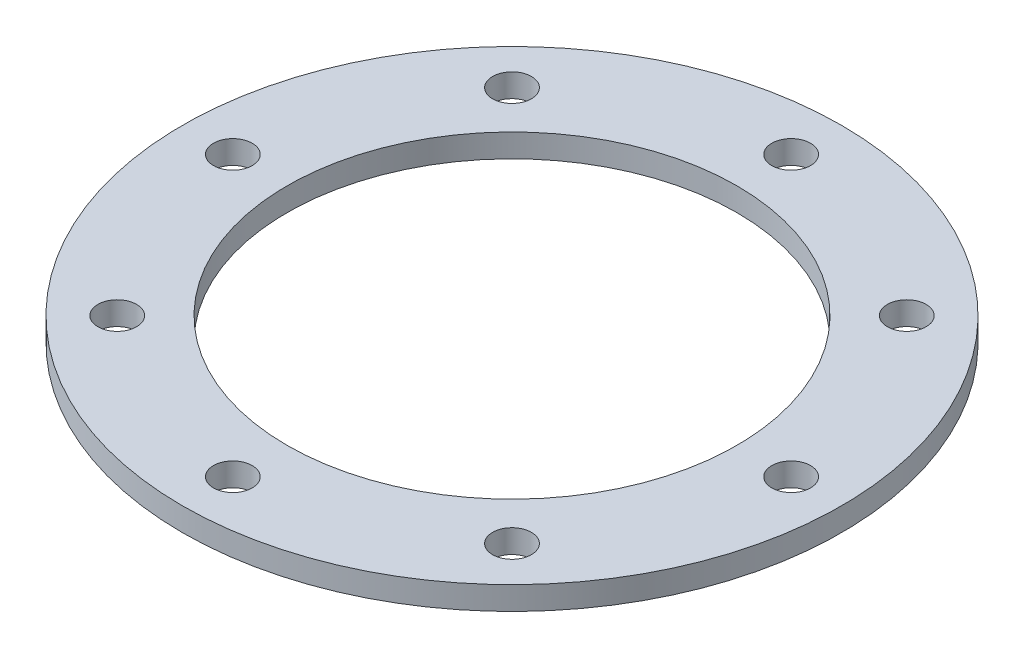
ISO-10303-21;
HEADER;
FILE_DESCRIPTION(('STEP AP214'),'2;1');
FILE_NAME('part.step','',(''),(''),'','','');
FILE_SCHEMA(('AUTOMOTIVE_DESIGN { 1 0 10303 214 1 1 1 1 }'));
ENDSEC;
DATA;
#1=APPLICATION_CONTEXT('core data for automotive mechanical design processes');
#2=APPLICATION_PROTOCOL_DEFINITION('international standard','automotive_design',2000,#1);
#3=PRODUCT_CONTEXT('',#1,'mechanical');
#4=PRODUCT('Part','Part','',(#3));
#5=PRODUCT_RELATED_PRODUCT_CATEGORY('part','',(#4));
#6=PRODUCT_DEFINITION_FORMATION('','',#4);
#7=PRODUCT_DEFINITION_CONTEXT('part definition',#1,'design');
#8=PRODUCT_DEFINITION('design','',#6,#7);
#9=PRODUCT_DEFINITION_SHAPE('','',#8);
#10=(LENGTH_UNIT() NAMED_UNIT(*) SI_UNIT(.MILLI.,.METRE.));
#11=(NAMED_UNIT(*) PLANE_ANGLE_UNIT() SI_UNIT($,.RADIAN.));
#12=(NAMED_UNIT(*) SI_UNIT($,.STERADIAN.) SOLID_ANGLE_UNIT());
#13=UNCERTAINTY_MEASURE_WITH_UNIT(LENGTH_MEASURE(1.E-05),#10,'distance_accuracy_value','');
#14=(GEOMETRIC_REPRESENTATION_CONTEXT(3) GLOBAL_UNCERTAINTY_ASSIGNED_CONTEXT((#13)) GLOBAL_UNIT_ASSIGNED_CONTEXT((#10,
#11,#12)) REPRESENTATION_CONTEXT('',''));
#15=CARTESIAN_POINT('',(0.,0.,0.));
#16=DIRECTION('',(0.,0.,1.));
#17=DIRECTION('',(1.,0.,0.));
#18=AXIS2_PLACEMENT_3D('',#15,#16,#17);
#19=CARTESIAN_POINT('',(0.,3.,0.));
#20=DIRECTION('',(0.,1.,0.));
#21=DIRECTION('',(0.,0.,1.));
#22=AXIS2_PLACEMENT_3D('',#19,#20,#21);
#23=PLANE('',#22);
#24=CARTESIAN_POINT('',(0.,3.,-36.));
#25=DIRECTION('',(0.,1.,0.));
#26=DIRECTION('',(0.,0.,1.));
#27=AXIS2_PLACEMENT_3D('',#24,#25,#26);
#28=CIRCLE('',#27,2.5);
#29=CARTESIAN_POINT('',(0.,3.,-33.5));
#30=VERTEX_POINT('',#29);
#31=EDGE_CURVE('E108',#30,#30,#28,.T.);
#32=ORIENTED_EDGE('',*,*,#31,.F.);
#33=EDGE_LOOP('',(#32));
#34=FACE_BOUND('',#33,.T.);
#35=CARTESIAN_POINT('',(-36.,3.,0.));
#36=DIRECTION('',(0.,1.,0.));
#37=DIRECTION('',(0.,0.,1.));
#38=AXIS2_PLACEMENT_3D('',#35,#36,#37);
#39=CIRCLE('',#38,2.5);
#40=CARTESIAN_POINT('',(-36.,3.,2.50000000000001));
#41=VERTEX_POINT('',#40);
#42=EDGE_CURVE('E92',#41,#41,#39,.T.);
#43=ORIENTED_EDGE('',*,*,#42,.F.);
#44=EDGE_LOOP('',(#43));
#45=FACE_BOUND('',#44,.T.);
#46=CARTESIAN_POINT('',(0.,3.,36.));
#47=DIRECTION('',(0.,1.,0.));
#48=DIRECTION('',(0.,0.,1.));
#49=AXIS2_PLACEMENT_3D('',#46,#47,#48);
#50=CIRCLE('',#49,2.5);
#51=CARTESIAN_POINT('',(0.,3.,38.5));
#52=VERTEX_POINT('',#51);
#53=EDGE_CURVE('E76',#52,#52,#50,.T.);
#54=ORIENTED_EDGE('',*,*,#53,.F.);
#55=EDGE_LOOP('',(#54));
#56=FACE_BOUND('',#55,.T.);
#57=CARTESIAN_POINT('',(36.,3.,0.));
#58=DIRECTION('',(0.,1.,0.));
#59=DIRECTION('',(0.,0.,1.));
#60=AXIS2_PLACEMENT_3D('',#57,#58,#59);
#61=CIRCLE('',#60,2.5);
#62=CARTESIAN_POINT('',(36.,3.,2.5));
#63=VERTEX_POINT('',#62);
#64=EDGE_CURVE('E60',#63,#63,#61,.T.);
#65=ORIENTED_EDGE('',*,*,#64,.F.);
#66=EDGE_LOOP('',(#65));
#67=FACE_BOUND('',#66,.T.);
#68=CARTESIAN_POINT('',(0.,3.,0.));
#69=DIRECTION('',(0.,1.,0.));
#70=DIRECTION('',(0.,0.,1.));
#71=AXIS2_PLACEMENT_3D('',#68,#69,#70);
#72=CIRCLE('',#71,42.5);
#73=CARTESIAN_POINT('',(0.,3.,42.5));
#74=VERTEX_POINT('',#73);
#75=EDGE_CURVE('E10',#74,#74,#72,.T.);
#76=ORIENTED_EDGE('',*,*,#75,.T.);
#77=EDGE_LOOP('',(#76));
#78=FACE_BOUND('',#77,.T.);
#79=CARTESIAN_POINT('',(0.,3.,0.));
#80=DIRECTION('',(0.,1.,0.));
#81=DIRECTION('',(0.,0.,1.));
#82=AXIS2_PLACEMENT_3D('',#79,#80,#81);
#83=CIRCLE('',#82,29.);
#84=CARTESIAN_POINT('',(0.,3.,29.));
#85=VERTEX_POINT('',#84);
#86=EDGE_CURVE('E54',#85,#85,#83,.T.);
#87=ORIENTED_EDGE('',*,*,#86,.F.);
#88=EDGE_LOOP('',(#87));
#89=FACE_BOUND('',#88,.T.);
#90=CARTESIAN_POINT('',(25.4558441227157,3.,25.4558441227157));
#91=DIRECTION('',(0.,1.,0.));
#92=DIRECTION('',(0.,0.,1.));
#93=AXIS2_PLACEMENT_3D('',#90,#91,#92);
#94=CIRCLE('',#93,2.5);
#95=CARTESIAN_POINT('',(25.4558441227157,3.,27.9558441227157));
#96=VERTEX_POINT('',#95);
#97=EDGE_CURVE('E68',#96,#96,#94,.T.);
#98=ORIENTED_EDGE('',*,*,#97,.F.);
#99=EDGE_LOOP('',(#98));
#100=FACE_BOUND('',#99,.T.);
#101=CARTESIAN_POINT('',(-25.4558441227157,3.,25.4558441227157));
#102=DIRECTION('',(0.,1.,0.));
#103=DIRECTION('',(0.,0.,1.));
#104=AXIS2_PLACEMENT_3D('',#101,#102,#103);
#105=CIRCLE('',#104,2.5);
#106=CARTESIAN_POINT('',(-25.4558441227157,3.,27.9558441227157));
#107=VERTEX_POINT('',#106);
#108=EDGE_CURVE('E84',#107,#107,#105,.T.);
#109=ORIENTED_EDGE('',*,*,#108,.F.);
#110=EDGE_LOOP('',(#109));
#111=FACE_BOUND('',#110,.T.);
#112=CARTESIAN_POINT('',(-25.4558441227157,3.,-25.4558441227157));
#113=DIRECTION('',(0.,1.,0.));
#114=DIRECTION('',(0.,0.,1.));
#115=AXIS2_PLACEMENT_3D('',#112,#113,#114);
#116=CIRCLE('',#115,2.5);
#117=CARTESIAN_POINT('',(-25.4558441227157,3.,-22.9558441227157));
#118=VERTEX_POINT('',#117);
#119=EDGE_CURVE('E100',#118,#118,#116,.T.);
#120=ORIENTED_EDGE('',*,*,#119,.F.);
#121=EDGE_LOOP('',(#120));
#122=FACE_BOUND('',#121,.T.);
#123=CARTESIAN_POINT('',(25.4558441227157,3.,-25.4558441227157));
#124=DIRECTION('',(0.,1.,0.));
#125=DIRECTION('',(0.,0.,1.));
#126=AXIS2_PLACEMENT_3D('',#123,#124,#125);
#127=CIRCLE('',#126,2.5);
#128=CARTESIAN_POINT('',(25.4558441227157,3.,-22.9558441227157));
#129=VERTEX_POINT('',#128);
#130=EDGE_CURVE('E116',#129,#129,#127,.T.);
#131=ORIENTED_EDGE('',*,*,#130,.F.);
#132=EDGE_LOOP('',(#131));
#133=FACE_BOUND('',#132,.T.);
#134=ADVANCED_FACE('F41',(#34,#45,#56,#67,#78,#89,#100,#111,#122,#133),#23,.T.);
#135=CARTESIAN_POINT('',(0.,0.,0.));
#136=DIRECTION('',(0.,1.,0.));
#137=DIRECTION('',(0.,0.,1.));
#138=AXIS2_PLACEMENT_3D('',#135,#136,#137);
#139=PLANE('',#138);
#140=CARTESIAN_POINT('',(0.,0.,0.));
#141=DIRECTION('',(0.,1.,0.));
#142=DIRECTION('',(0.,0.,1.));
#143=AXIS2_PLACEMENT_3D('',#140,#141,#142);
#144=CIRCLE('',#143,42.5);
#145=CARTESIAN_POINT('',(0.,0.,42.5));
#146=VERTEX_POINT('',#145);
#147=EDGE_CURVE('E45',#146,#146,#144,.T.);
#148=ORIENTED_EDGE('',*,*,#147,.F.);
#149=EDGE_LOOP('',(#148));
#150=FACE_BOUND('',#149,.T.);
#151=CARTESIAN_POINT('',(0.,0.,0.));
#152=DIRECTION('',(0.,1.,0.));
#153=DIRECTION('',(0.,0.,1.));
#154=AXIS2_PLACEMENT_3D('',#151,#152,#153);
#155=CIRCLE('',#154,29.);
#156=CARTESIAN_POINT('',(0.,0.,29.));
#157=VERTEX_POINT('',#156);
#158=EDGE_CURVE('E56',#157,#157,#155,.T.);
#159=ORIENTED_EDGE('',*,*,#158,.T.);
#160=EDGE_LOOP('',(#159));
#161=FACE_BOUND('',#160,.T.);
#162=CARTESIAN_POINT('',(36.,0.,0.));
#163=DIRECTION('',(0.,1.,0.));
#164=DIRECTION('',(0.,0.,1.));
#165=AXIS2_PLACEMENT_3D('',#162,#163,#164);
#166=CIRCLE('',#165,2.5);
#167=CARTESIAN_POINT('',(36.,0.,2.5));
#168=VERTEX_POINT('',#167);
#169=EDGE_CURVE('E64',#168,#168,#166,.T.);
#170=ORIENTED_EDGE('',*,*,#169,.T.);
#171=EDGE_LOOP('',(#170));
#172=FACE_BOUND('',#171,.T.);
#173=CARTESIAN_POINT('',(25.4558441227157,0.,25.4558441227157));
#174=DIRECTION('',(0.,1.,0.));
#175=DIRECTION('',(0.,0.,1.));
#176=AXIS2_PLACEMENT_3D('',#173,#174,#175);
#177=CIRCLE('',#176,2.5);
#178=CARTESIAN_POINT('',(25.4558441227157,0.,27.9558441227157));
#179=VERTEX_POINT('',#178);
#180=EDGE_CURVE('E72',#179,#179,#177,.T.);
#181=ORIENTED_EDGE('',*,*,#180,.T.);
#182=EDGE_LOOP('',(#181));
#183=FACE_BOUND('',#182,.T.);
#184=CARTESIAN_POINT('',(0.,0.,36.));
#185=DIRECTION('',(0.,1.,0.));
#186=DIRECTION('',(0.,0.,1.));
#187=AXIS2_PLACEMENT_3D('',#184,#185,#186);
#188=CIRCLE('',#187,2.5);
#189=CARTESIAN_POINT('',(0.,0.,38.5));
#190=VERTEX_POINT('',#189);
#191=EDGE_CURVE('E80',#190,#190,#188,.T.);
#192=ORIENTED_EDGE('',*,*,#191,.T.);
#193=EDGE_LOOP('',(#192));
#194=FACE_BOUND('',#193,.T.);
#195=CARTESIAN_POINT('',(-25.4558441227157,0.,25.4558441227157));
#196=DIRECTION('',(0.,1.,0.));
#197=DIRECTION('',(0.,0.,1.));
#198=AXIS2_PLACEMENT_3D('',#195,#196,#197);
#199=CIRCLE('',#198,2.5);
#200=CARTESIAN_POINT('',(-25.4558441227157,0.,27.9558441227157));
#201=VERTEX_POINT('',#200);
#202=EDGE_CURVE('E88',#201,#201,#199,.T.);
#203=ORIENTED_EDGE('',*,*,#202,.T.);
#204=EDGE_LOOP('',(#203));
#205=FACE_BOUND('',#204,.T.);
#206=CARTESIAN_POINT('',(-36.,0.,0.));
#207=DIRECTION('',(0.,1.,0.));
#208=DIRECTION('',(0.,0.,1.));
#209=AXIS2_PLACEMENT_3D('',#206,#207,#208);
#210=CIRCLE('',#209,2.5);
#211=CARTESIAN_POINT('',(-36.,0.,2.50000000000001));
#212=VERTEX_POINT('',#211);
#213=EDGE_CURVE('E96',#212,#212,#210,.T.);
#214=ORIENTED_EDGE('',*,*,#213,.T.);
#215=EDGE_LOOP('',(#214));
#216=FACE_BOUND('',#215,.T.);
#217=CARTESIAN_POINT('',(-25.4558441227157,0.,-25.4558441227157));
#218=DIRECTION('',(0.,1.,0.));
#219=DIRECTION('',(0.,0.,1.));
#220=AXIS2_PLACEMENT_3D('',#217,#218,#219);
#221=CIRCLE('',#220,2.5);
#222=CARTESIAN_POINT('',(-25.4558441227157,0.,-22.9558441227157));
#223=VERTEX_POINT('',#222);
#224=EDGE_CURVE('E104',#223,#223,#221,.T.);
#225=ORIENTED_EDGE('',*,*,#224,.T.);
#226=EDGE_LOOP('',(#225));
#227=FACE_BOUND('',#226,.T.);
#228=CARTESIAN_POINT('',(0.,0.,-36.));
#229=DIRECTION('',(0.,1.,0.));
#230=DIRECTION('',(0.,0.,1.));
#231=AXIS2_PLACEMENT_3D('',#228,#229,#230);
#232=CIRCLE('',#231,2.5);
#233=CARTESIAN_POINT('',(0.,0.,-33.5));
#234=VERTEX_POINT('',#233);
#235=EDGE_CURVE('E112',#234,#234,#232,.T.);
#236=ORIENTED_EDGE('',*,*,#235,.T.);
#237=EDGE_LOOP('',(#236));
#238=FACE_BOUND('',#237,.T.);
#239=CARTESIAN_POINT('',(25.4558441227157,0.,-25.4558441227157));
#240=DIRECTION('',(0.,1.,0.));
#241=DIRECTION('',(0.,0.,1.));
#242=AXIS2_PLACEMENT_3D('',#239,#240,#241);
#243=CIRCLE('',#242,2.5);
#244=CARTESIAN_POINT('',(25.4558441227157,0.,-22.9558441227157));
#245=VERTEX_POINT('',#244);
#246=EDGE_CURVE('E120',#245,#245,#243,.T.);
#247=ORIENTED_EDGE('',*,*,#246,.T.);
#248=EDGE_LOOP('',(#247));
#249=FACE_BOUND('',#248,.T.);
#250=ADVANCED_FACE('F132',(#150,#161,#172,#183,#194,#205,#216,#227,#238,#249),#139,.F.);
#251=CARTESIAN_POINT('',(0.,3.,0.));
#252=DIRECTION('',(0.,-1.,0.));
#253=DIRECTION('',(0.,0.,-1.));
#254=AXIS2_PLACEMENT_3D('',#251,#252,#253);
#255=CYLINDRICAL_SURFACE('',#254,42.5);
#256=ORIENTED_EDGE('',*,*,#75,.F.);
#257=EDGE_LOOP('',(#256));
#258=FACE_BOUND('',#257,.T.);
#259=ORIENTED_EDGE('',*,*,#147,.T.);
#260=EDGE_LOOP('',(#259));
#261=FACE_BOUND('',#260,.T.);
#262=ADVANCED_FACE('F43',(#258,#261),#255,.T.);
#263=CARTESIAN_POINT('',(0.,3.,0.));
#264=DIRECTION('',(0.,-1.,0.));
#265=DIRECTION('',(0.,0.,-1.));
#266=AXIS2_PLACEMENT_3D('',#263,#264,#265);
#267=CYLINDRICAL_SURFACE('',#266,29.);
#268=ORIENTED_EDGE('',*,*,#86,.T.);
#269=EDGE_LOOP('',(#268));
#270=FACE_BOUND('',#269,.T.);
#271=ORIENTED_EDGE('',*,*,#158,.F.);
#272=EDGE_LOOP('',(#271));
#273=FACE_BOUND('',#272,.T.);
#274=ADVANCED_FACE('F142',(#270,#273),#267,.F.);
#275=CARTESIAN_POINT('',(36.,3.,0.));
#276=DIRECTION('',(0.,-1.,0.));
#277=DIRECTION('',(0.,0.,-1.));
#278=AXIS2_PLACEMENT_3D('',#275,#276,#277);
#279=CYLINDRICAL_SURFACE('',#278,2.5);
#280=ORIENTED_EDGE('',*,*,#64,.T.);
#281=EDGE_LOOP('',(#280));
#282=FACE_BOUND('',#281,.T.);
#283=ORIENTED_EDGE('',*,*,#169,.F.);
#284=EDGE_LOOP('',(#283));
#285=FACE_BOUND('',#284,.T.);
#286=ADVANCED_FACE('F145',(#282,#285),#279,.F.);
#287=CARTESIAN_POINT('',(25.4558441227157,3.,25.4558441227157));
#288=DIRECTION('',(0.,-1.,0.));
#289=DIRECTION('',(0.,0.,-1.));
#290=AXIS2_PLACEMENT_3D('',#287,#288,#289);
#291=CYLINDRICAL_SURFACE('',#290,2.5);
#292=ORIENTED_EDGE('',*,*,#97,.T.);
#293=EDGE_LOOP('',(#292));
#294=FACE_BOUND('',#293,.T.);
#295=ORIENTED_EDGE('',*,*,#180,.F.);
#296=EDGE_LOOP('',(#295));
#297=FACE_BOUND('',#296,.T.);
#298=ADVANCED_FACE('F149',(#294,#297),#291,.F.);
#299=CARTESIAN_POINT('',(0.,3.,36.));
#300=DIRECTION('',(0.,-1.,0.));
#301=DIRECTION('',(0.,0.,-1.));
#302=AXIS2_PLACEMENT_3D('',#299,#300,#301);
#303=CYLINDRICAL_SURFACE('',#302,2.5);
#304=ORIENTED_EDGE('',*,*,#53,.T.);
#305=EDGE_LOOP('',(#304));
#306=FACE_BOUND('',#305,.T.);
#307=ORIENTED_EDGE('',*,*,#191,.F.);
#308=EDGE_LOOP('',(#307));
#309=FACE_BOUND('',#308,.T.);
#310=ADVANCED_FACE('F153',(#306,#309),#303,.F.);
#311=CARTESIAN_POINT('',(-25.4558441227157,3.,25.4558441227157));
#312=DIRECTION('',(0.,-1.,0.));
#313=DIRECTION('',(0.,0.,-1.));
#314=AXIS2_PLACEMENT_3D('',#311,#312,#313);
#315=CYLINDRICAL_SURFACE('',#314,2.5);
#316=ORIENTED_EDGE('',*,*,#108,.T.);
#317=EDGE_LOOP('',(#316));
#318=FACE_BOUND('',#317,.T.);
#319=ORIENTED_EDGE('',*,*,#202,.F.);
#320=EDGE_LOOP('',(#319));
#321=FACE_BOUND('',#320,.T.);
#322=ADVANCED_FACE('F157',(#318,#321),#315,.F.);
#323=CARTESIAN_POINT('',(-36.,3.,0.));
#324=DIRECTION('',(0.,-1.,0.));
#325=DIRECTION('',(0.,0.,-1.));
#326=AXIS2_PLACEMENT_3D('',#323,#324,#325);
#327=CYLINDRICAL_SURFACE('',#326,2.5);
#328=ORIENTED_EDGE('',*,*,#42,.T.);
#329=EDGE_LOOP('',(#328));
#330=FACE_BOUND('',#329,.T.);
#331=ORIENTED_EDGE('',*,*,#213,.F.);
#332=EDGE_LOOP('',(#331));
#333=FACE_BOUND('',#332,.T.);
#334=ADVANCED_FACE('F161',(#330,#333),#327,.F.);
#335=CARTESIAN_POINT('',(-25.4558441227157,3.,-25.4558441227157));
#336=DIRECTION('',(0.,-1.,0.));
#337=DIRECTION('',(0.,0.,-1.));
#338=AXIS2_PLACEMENT_3D('',#335,#336,#337);
#339=CYLINDRICAL_SURFACE('',#338,2.5);
#340=ORIENTED_EDGE('',*,*,#119,.T.);
#341=EDGE_LOOP('',(#340));
#342=FACE_BOUND('',#341,.T.);
#343=ORIENTED_EDGE('',*,*,#224,.F.);
#344=EDGE_LOOP('',(#343));
#345=FACE_BOUND('',#344,.T.);
#346=ADVANCED_FACE('F165',(#342,#345),#339,.F.);
#347=CARTESIAN_POINT('',(0.,3.,-36.));
#348=DIRECTION('',(0.,-1.,0.));
#349=DIRECTION('',(0.,0.,-1.));
#350=AXIS2_PLACEMENT_3D('',#347,#348,#349);
#351=CYLINDRICAL_SURFACE('',#350,2.5);
#352=ORIENTED_EDGE('',*,*,#31,.T.);
#353=EDGE_LOOP('',(#352));
#354=FACE_BOUND('',#353,.T.);
#355=ORIENTED_EDGE('',*,*,#235,.F.);
#356=EDGE_LOOP('',(#355));
#357=FACE_BOUND('',#356,.T.);
#358=ADVANCED_FACE('F169',(#354,#357),#351,.F.);
#359=CARTESIAN_POINT('',(25.4558441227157,3.,-25.4558441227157));
#360=DIRECTION('',(0.,-1.,0.));
#361=DIRECTION('',(0.,0.,-1.));
#362=AXIS2_PLACEMENT_3D('',#359,#360,#361);
#363=CYLINDRICAL_SURFACE('',#362,2.5);
#364=ORIENTED_EDGE('',*,*,#130,.T.);
#365=EDGE_LOOP('',(#364));
#366=FACE_BOUND('',#365,.T.);
#367=ORIENTED_EDGE('',*,*,#246,.F.);
#368=EDGE_LOOP('',(#367));
#369=FACE_BOUND('',#368,.T.);
#370=ADVANCED_FACE('F128',(#366,#369),#363,.F.);
#371=CLOSED_SHELL('',(#134,#250,#262,#274,#286,#298,#310,#322,#334,#346,#358,#370));
#372=MANIFOLD_SOLID_BREP('B2',#371);
#373=ADVANCED_BREP_SHAPE_REPRESENTATION('',(#18,#372),#14);
#374=SHAPE_DEFINITION_REPRESENTATION(#9,#373);
ENDSEC;
END-ISO-10303-21;
